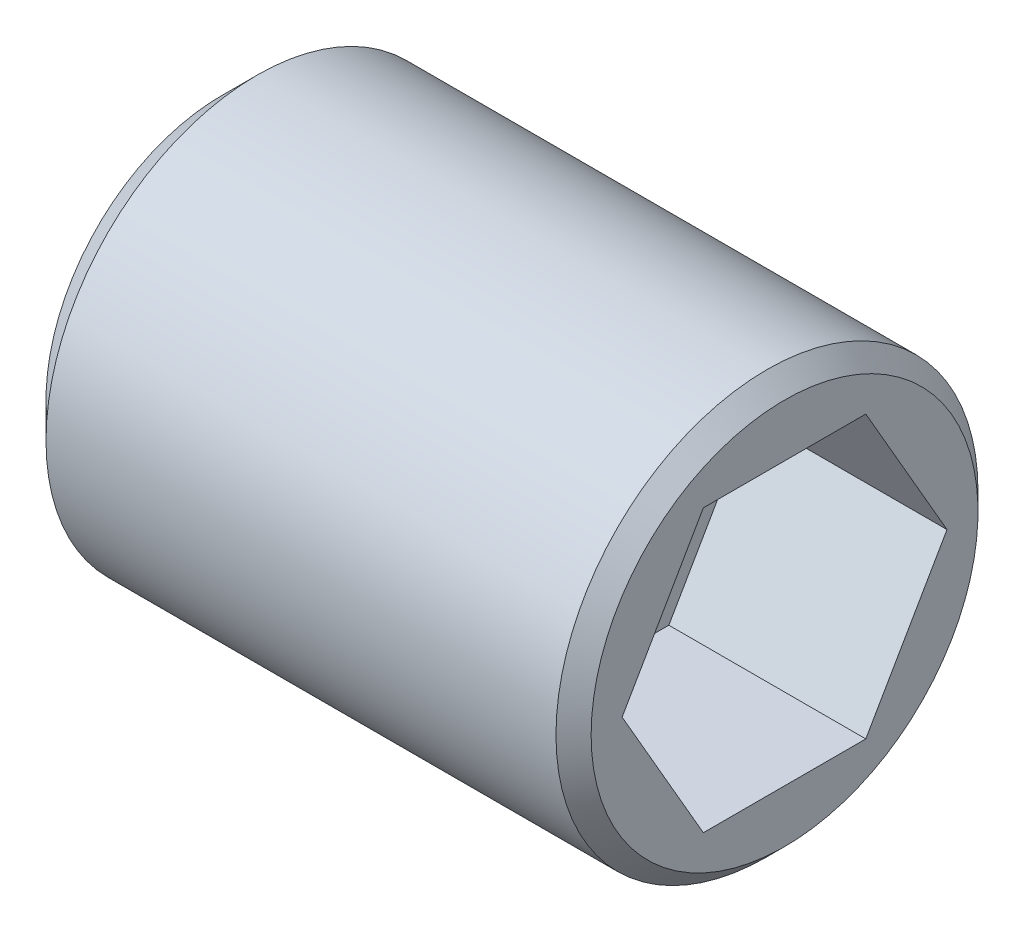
from build123d import *

# Parameters (mm, degrees)
ESQUISSE1_W             = 8
ESQUISSE1_H             = 3
CHANFREIN2_SIZE         = 0.5
EMPREINTE_POUR_CL_DEPTH = 2.8
CHANFREIN3_SIZE         = 0.25


with BuildPart() as part:
    # Esquisse1 → Base-R_volution (revolve)
    with BuildSketch(Plane.XY, mode=Mode.PRIVATE) as base_r_volution_sk:
        with Locations((4, 1.5)):
            Rectangle(ESQUISSE1_W, ESQUISSE1_H)
    revolve(base_r_volution_sk.sketch.rotate(Axis((-25.828475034, 0, 0), (1, 0, 0)), 90), axis=Axis((-25.828475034, 0, 0), (1, 0, 0)))

    # Chanfrein2
    chanfrein2_edges = [part.edges().sort_by_distance(p)[0] for p in [
        (0, 0, -3),
    ]]
    chamfer(chanfrein2_edges, length=CHANFREIN2_SIZE)

    # Esquisse2 → Empreinte pour cl (cut)
    with BuildSketch(Plane(origin=(8, 0, 0), x_dir=(0, 0, -1), z_dir=(1, 0, 0))):
        Polygon((2.309401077, 0), (1.154700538, 2), (-1.154700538, 2), (-2.309401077, 0), (-1.154700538, -2), (1.154700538, -2), align=None)
    extrude(amount=-EMPREINTE_POUR_CL_DEPTH, mode=Mode.SUBTRACT)

    # Chanfrein3
    chanfrein3_edges = [part.edges().sort_by_distance(p)[0] for p in [
        (8, 0, -3),
    ]]
    chamfer(chanfrein3_edges, length=CHANFREIN3_SIZE)


solid = part.part
